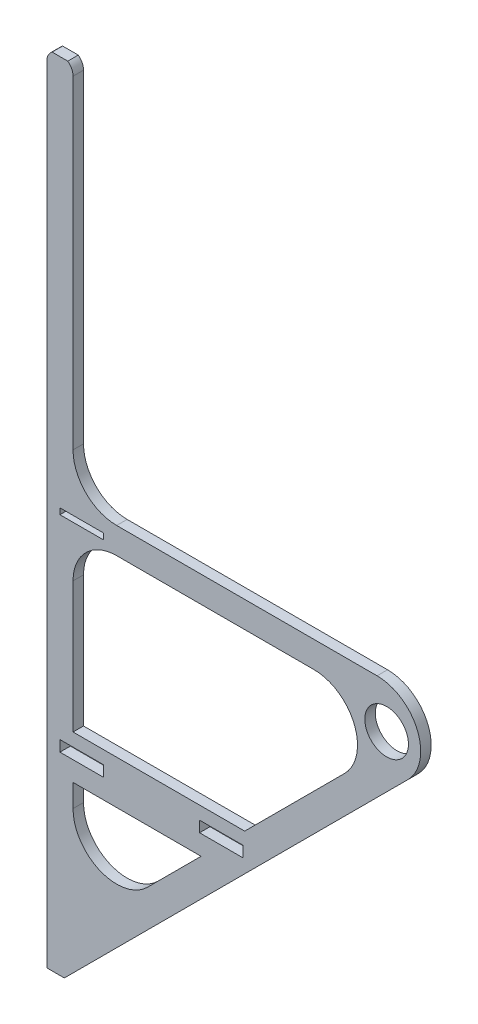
ISO-10303-21;
HEADER;
FILE_DESCRIPTION(('STEP AP214'),'2;1');
FILE_NAME('part.step','',(''),(''),'','','');
FILE_SCHEMA(('AUTOMOTIVE_DESIGN { 1 0 10303 214 1 1 1 1 }'));
ENDSEC;
DATA;
#1=APPLICATION_CONTEXT('core data for automotive mechanical design processes');
#2=APPLICATION_PROTOCOL_DEFINITION('international standard','automotive_design',2000,#1);
#3=PRODUCT_CONTEXT('',#1,'mechanical');
#4=PRODUCT('Part','Part','',(#3));
#5=PRODUCT_RELATED_PRODUCT_CATEGORY('part','',(#4));
#6=PRODUCT_DEFINITION_FORMATION('','',#4);
#7=PRODUCT_DEFINITION_CONTEXT('part definition',#1,'design');
#8=PRODUCT_DEFINITION('design','',#6,#7);
#9=PRODUCT_DEFINITION_SHAPE('','',#8);
#10=(LENGTH_UNIT() NAMED_UNIT(*) SI_UNIT(.MILLI.,.METRE.));
#11=(NAMED_UNIT(*) PLANE_ANGLE_UNIT() SI_UNIT($,.RADIAN.));
#12=(NAMED_UNIT(*) SI_UNIT($,.STERADIAN.) SOLID_ANGLE_UNIT());
#13=UNCERTAINTY_MEASURE_WITH_UNIT(LENGTH_MEASURE(1.E-05),#10,'distance_accuracy_value','');
#14=(GEOMETRIC_REPRESENTATION_CONTEXT(3) GLOBAL_UNCERTAINTY_ASSIGNED_CONTEXT((#13)) GLOBAL_UNIT_ASSIGNED_CONTEXT((#10,
#11,#12)) REPRESENTATION_CONTEXT('',''));
#15=CARTESIAN_POINT('',(0.,0.,0.));
#16=DIRECTION('',(0.,0.,1.));
#17=DIRECTION('',(1.,0.,0.));
#18=AXIS2_PLACEMENT_3D('',#15,#16,#17);
#19=CARTESIAN_POINT('',(378.43890071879,429.149578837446,12.));
#20=DIRECTION('',(0.,0.,1.));
#21=DIRECTION('',(1.,0.,0.));
#22=AXIS2_PLACEMENT_3D('',#19,#20,#21);
#23=PLANE('',#22);
#24=DIRECTION('',(0.,-1.,0.));
#25=VECTOR('',#24,1.);
#26=CARTESIAN_POINT('',(175.,234.149578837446,12.));
#27=LINE('',#26,#25);
#28=CARTESIAN_POINT('',(175.,234.149578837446,12.));
#29=VERTEX_POINT('',#28);
#30=CARTESIAN_POINT('',(175.,221.649578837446,12.));
#31=VERTEX_POINT('',#30);
#32=EDGE_CURVE('E48',#29,#31,#27,.T.);
#33=ORIENTED_EDGE('',*,*,#32,.F.);
#34=DIRECTION('',(-1.,0.,0.));
#35=VECTOR('',#34,1.);
#36=CARTESIAN_POINT('',(175.,234.149578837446,12.));
#37=LINE('',#36,#35);
#38=CARTESIAN_POINT('',(225.,234.149578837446,12.));
#39=VERTEX_POINT('',#38);
#40=EDGE_CURVE('E260',#39,#29,#37,.T.);
#41=ORIENTED_EDGE('',*,*,#40,.F.);
#42=DIRECTION('',(0.,1.,0.));
#43=VECTOR('',#42,1.);
#44=CARTESIAN_POINT('',(225.,234.149578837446,12.));
#45=LINE('',#44,#43);
#46=CARTESIAN_POINT('',(225.,221.649578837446,12.));
#47=VERTEX_POINT('',#46);
#48=EDGE_CURVE('E263',#47,#39,#45,.T.);
#49=ORIENTED_EDGE('',*,*,#48,.F.);
#50=DIRECTION('',(1.,0.,0.));
#51=VECTOR('',#50,1.);
#52=CARTESIAN_POINT('',(175.,221.649578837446,12.));
#53=LINE('',#52,#51);
#54=EDGE_CURVE('E269',#31,#47,#53,.T.);
#55=ORIENTED_EDGE('',*,*,#54,.F.);
#56=EDGE_LOOP('',(#33,#41,#49,#55));
#57=FACE_BOUND('',#56,.T.);
#58=DIRECTION('',(0.,-1.,0.));
#59=VECTOR('',#58,1.);
#60=CARTESIAN_POINT('',(14.9999999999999,234.149578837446,12.));
#61=LINE('',#60,#59);
#62=CARTESIAN_POINT('',(14.9999999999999,234.149578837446,12.));
#63=VERTEX_POINT('',#62);
#64=CARTESIAN_POINT('',(14.9999999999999,221.649578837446,12.));
#65=VERTEX_POINT('',#64);
#66=EDGE_CURVE('E275',#63,#65,#61,.T.);
#67=ORIENTED_EDGE('',*,*,#66,.F.);
#68=DIRECTION('',(-1.,0.,0.));
#69=VECTOR('',#68,1.);
#70=CARTESIAN_POINT('',(14.9999999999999,234.149578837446,12.));
#71=LINE('',#70,#69);
#72=CARTESIAN_POINT('',(64.9999999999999,234.149578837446,12.));
#73=VERTEX_POINT('',#72);
#74=EDGE_CURVE('E283',#73,#63,#71,.T.);
#75=ORIENTED_EDGE('',*,*,#74,.F.);
#76=DIRECTION('',(0.,1.,0.));
#77=VECTOR('',#76,1.);
#78=CARTESIAN_POINT('',(64.9999999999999,234.149578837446,12.));
#79=LINE('',#78,#77);
#80=CARTESIAN_POINT('',(64.9999999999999,221.649578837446,12.));
#81=VERTEX_POINT('',#80);
#82=EDGE_CURVE('E297',#81,#73,#79,.T.);
#83=ORIENTED_EDGE('',*,*,#82,.F.);
#84=DIRECTION('',(1.,0.,0.));
#85=VECTOR('',#84,1.);
#86=CARTESIAN_POINT('',(14.9999999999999,221.649578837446,12.));
#87=LINE('',#86,#85);
#88=EDGE_CURVE('E294',#65,#81,#87,.T.);
#89=ORIENTED_EDGE('',*,*,#88,.F.);
#90=EDGE_LOOP('',(#67,#75,#83,#89));
#91=FACE_BOUND('',#90,.T.);
#92=DIRECTION('',(0.707106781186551,0.707106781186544,0.));
#93=VECTOR('',#92,1.);
#94=CARTESIAN_POINT('',(176.72317196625,199.149578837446,12.));
#95=LINE('',#94,#93);
#96=CARTESIAN_POINT('',(115.355339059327,137.781745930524,12.));
#97=VERTEX_POINT('',#96);
#98=CARTESIAN_POINT('',(176.72317196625,199.149578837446,12.));
#99=VERTEX_POINT('',#98);
#100=EDGE_CURVE('E350',#97,#99,#95,.T.);
#101=ORIENTED_EDGE('',*,*,#100,.F.);
#102=CARTESIAN_POINT('',(80.,173.137084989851,12.));
#103=DIRECTION('',(0.,0.,1.));
#104=DIRECTION('',(1.,0.,0.));
#105=AXIS2_PLACEMENT_3D('',#102,#103,#104);
#106=CIRCLE('',#105,50.);
#107=CARTESIAN_POINT('',(30.,173.137084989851,12.));
#108=VERTEX_POINT('',#107);
#109=EDGE_CURVE('E348',#108,#97,#106,.T.);
#110=ORIENTED_EDGE('',*,*,#109,.F.);
#111=DIRECTION('',(0.,-1.,0.));
#112=VECTOR('',#111,1.);
#113=CARTESIAN_POINT('',(30.,173.137084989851,12.));
#114=LINE('',#113,#112);
#115=CARTESIAN_POINT('',(30.,199.149578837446,12.));
#116=VERTEX_POINT('',#115);
#117=EDGE_CURVE('E356',#116,#108,#114,.T.);
#118=ORIENTED_EDGE('',*,*,#117,.F.);
#119=DIRECTION('',(-1.,0.,0.));
#120=VECTOR('',#119,1.);
#121=CARTESIAN_POINT('',(30.,199.149578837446,12.));
#122=LINE('',#121,#120);
#123=EDGE_CURVE('E353',#99,#116,#122,.T.);
#124=ORIENTED_EDGE('',*,*,#123,.F.);
#125=EDGE_LOOP('',(#101,#110,#118,#124));
#126=FACE_BOUND('',#125,.T.);
#127=DIRECTION('',(0.,-1.,0.));
#128=VECTOR('',#127,1.);
#129=CARTESIAN_POINT('',(30.,249.149578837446,12.));
#130=LINE('',#129,#128);
#131=CARTESIAN_POINT('',(30.,399.149578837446,12.));
#132=VERTEX_POINT('',#131);
#133=CARTESIAN_POINT('',(30.,249.149578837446,12.));
#134=VERTEX_POINT('',#133);
#135=EDGE_CURVE('E381',#132,#134,#130,.T.);
#136=ORIENTED_EDGE('',*,*,#135,.F.);
#137=CARTESIAN_POINT('',(80.,399.149578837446,12.));
#138=DIRECTION('',(0.,0.,1.));
#139=DIRECTION('',(1.,0.,0.));
#140=AXIS2_PLACEMENT_3D('',#137,#138,#139);
#141=CIRCLE('',#140,50.);
#142=CARTESIAN_POINT('',(80.,449.149578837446,12.));
#143=VERTEX_POINT('',#142);
#144=EDGE_CURVE('E379',#143,#132,#141,.T.);
#145=ORIENTED_EDGE('',*,*,#144,.F.);
#146=DIRECTION('',(-1.,0.,0.));
#147=VECTOR('',#146,1.);
#148=CARTESIAN_POINT('',(80.,449.149578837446,12.));
#149=LINE('',#148,#147);
#150=CARTESIAN_POINT('',(306.012493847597,449.149578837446,12.));
#151=VERTEX_POINT('',#150);
#152=EDGE_CURVE('E391',#151,#143,#149,.T.);
#153=ORIENTED_EDGE('',*,*,#152,.F.);
#154=CARTESIAN_POINT('',(306.012493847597,399.149578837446,12.));
#155=DIRECTION('',(0.,0.,1.));
#156=DIRECTION('',(1.,0.,0.));
#157=AXIS2_PLACEMENT_3D('',#154,#155,#156);
#158=CIRCLE('',#157,50.);
#159=CARTESIAN_POINT('',(341.367832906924,363.794239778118,12.));
#160=VERTEX_POINT('',#159);
#161=EDGE_CURVE('E388',#160,#151,#158,.T.);
#162=ORIENTED_EDGE('',*,*,#161,.F.);
#163=DIRECTION('',(0.707106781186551,0.707106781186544,0.));
#164=VECTOR('',#163,1.);
#165=CARTESIAN_POINT('',(341.367832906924,363.794239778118,12.));
#166=LINE('',#165,#164);
#167=CARTESIAN_POINT('',(226.72317196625,249.149578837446,12.));
#168=VERTEX_POINT('',#167);
#169=EDGE_CURVE('E386',#168,#160,#166,.T.);
#170=ORIENTED_EDGE('',*,*,#169,.F.);
#171=DIRECTION('',(1.,0.,0.));
#172=VECTOR('',#171,1.);
#173=CARTESIAN_POINT('',(30.,249.149578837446,12.));
#174=LINE('',#173,#172);
#175=EDGE_CURVE('E384',#134,#168,#174,.T.);
#176=ORIENTED_EDGE('',*,*,#175,.F.);
#177=EDGE_LOOP('',(#136,#145,#153,#162,#170,#176));
#178=FACE_BOUND('',#177,.T.);
#179=DIRECTION('',(0.,-1.,0.));
#180=VECTOR('',#179,1.);
#181=CARTESIAN_POINT('',(0.,900.,12.));
#182=LINE('',#181,#180);
#183=CARTESIAN_POINT('',(0.,900.,12.));
#184=VERTEX_POINT('',#183);
#185=CARTESIAN_POINT('',(0.,0.,12.));
#186=VERTEX_POINT('',#185);
#187=EDGE_CURVE('E424',#184,#186,#182,.T.);
#188=ORIENTED_EDGE('',*,*,#187,.T.);
#189=DIRECTION('',(1.,0.,0.));
#190=VECTOR('',#189,1.);
#191=CARTESIAN_POINT('',(0.,0.,12.));
#192=LINE('',#191,#190);
#193=CARTESIAN_POINT('',(19.9999999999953,0.,12.));
#194=VERTEX_POINT('',#193);
#195=EDGE_CURVE('E426',#186,#194,#192,.T.);
#196=ORIENTED_EDGE('',*,*,#195,.T.);
#197=DIRECTION('',(0.707106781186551,0.707106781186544,0.));
#198=VECTOR('',#197,1.);
#199=CARTESIAN_POINT('',(19.9999999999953,0.,12.));
#200=LINE('',#199,#198);
#201=CARTESIAN_POINT('',(413.794239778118,393.794239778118,12.));
#202=VERTEX_POINT('',#201);
#203=EDGE_CURVE('E429',#194,#202,#200,.T.);
#204=ORIENTED_EDGE('',*,*,#203,.T.);
#205=CARTESIAN_POINT('',(378.43890071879,429.149578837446,12.));
#206=DIRECTION('',(0.,0.,1.));
#207=DIRECTION('',(1.,0.,0.));
#208=AXIS2_PLACEMENT_3D('',#205,#206,#207);
#209=CIRCLE('',#208,50.);
#210=CARTESIAN_POINT('',(378.43890071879,479.149578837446,12.));
#211=VERTEX_POINT('',#210);
#212=EDGE_CURVE('E431',#202,#211,#209,.T.);
#213=ORIENTED_EDGE('',*,*,#212,.T.);
#214=DIRECTION('',(-1.,0.,0.));
#215=VECTOR('',#214,1.);
#216=CARTESIAN_POINT('',(378.43890071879,479.149578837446,12.));
#217=LINE('',#216,#215);
#218=CARTESIAN_POINT('',(80.0000000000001,479.149578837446,12.));
#219=VERTEX_POINT('',#218);
#220=EDGE_CURVE('E433',#211,#219,#217,.T.);
#221=ORIENTED_EDGE('',*,*,#220,.T.);
#222=CARTESIAN_POINT('',(80.0000000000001,529.149578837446,12.));
#223=DIRECTION('',(0.,0.,-1.));
#224=DIRECTION('',(-1.,0.,0.));
#225=AXIS2_PLACEMENT_3D('',#222,#223,#224);
#226=CIRCLE('',#225,50.);
#227=CARTESIAN_POINT('',(30.0000000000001,529.149578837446,12.));
#228=VERTEX_POINT('',#227);
#229=EDGE_CURVE('E435',#219,#228,#226,.T.);
#230=ORIENTED_EDGE('',*,*,#229,.T.);
#231=DIRECTION('',(0.,1.,0.));
#232=VECTOR('',#231,1.);
#233=CARTESIAN_POINT('',(29.9999999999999,900.,12.));
#234=LINE('',#233,#232);
#235=CARTESIAN_POINT('',(29.9999999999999,900.,12.));
#236=VERTEX_POINT('',#235);
#237=EDGE_CURVE('E437',#228,#236,#234,.T.);
#238=ORIENTED_EDGE('',*,*,#237,.T.);
#239=CARTESIAN_POINT('',(14.9999999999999,900.,12.));
#240=DIRECTION('',(0.,0.,1.));
#241=DIRECTION('',(-1.,0.,0.));
#242=AXIS2_PLACEMENT_3D('',#239,#240,#241);
#243=CIRCLE('',#242,15.);
#244=CARTESIAN_POINT('',(23.9999999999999,912.,12.));
#245=VERTEX_POINT('',#244);
#246=EDGE_CURVE('E439',#236,#245,#243,.T.);
#247=ORIENTED_EDGE('',*,*,#246,.T.);
#248=DIRECTION('',(-1.,0.,0.));
#249=VECTOR('',#248,1.);
#250=CARTESIAN_POINT('',(5.99999999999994,912.,12.));
#251=LINE('',#250,#249);
#252=CARTESIAN_POINT('',(5.99999999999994,912.,12.));
#253=VERTEX_POINT('',#252);
#254=EDGE_CURVE('E441',#245,#253,#251,.T.);
#255=ORIENTED_EDGE('',*,*,#254,.T.);
#256=CARTESIAN_POINT('',(14.9999999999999,900.,12.));
#257=DIRECTION('',(0.,0.,1.));
#258=DIRECTION('',(-1.,0.,0.));
#259=AXIS2_PLACEMENT_3D('',#256,#257,#258);
#260=CIRCLE('',#259,15.);
#261=EDGE_CURVE('E443',#253,#184,#260,.T.);
#262=ORIENTED_EDGE('',*,*,#261,.T.);
#263=EDGE_LOOP('',(#188,#196,#204,#213,#221,#230,#238,#247,#255,#262));
#264=FACE_BOUND('',#263,.T.);
#265=CARTESIAN_POINT('',(389.394289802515,429.149578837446,12.));
#266=DIRECTION('',(0.,0.,1.));
#267=DIRECTION('',(1.,0.,0.));
#268=AXIS2_PLACEMENT_3D('',#265,#266,#267);
#269=CIRCLE('',#268,25.);
#270=CARTESIAN_POINT('',(414.394289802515,429.149578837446,12.));
#271=VERTEX_POINT('',#270);
#272=EDGE_CURVE('E342',#271,#271,#269,.T.);
#273=ORIENTED_EDGE('',*,*,#272,.F.);
#274=EDGE_LOOP('',(#273));
#275=FACE_BOUND('',#274,.T.);
#276=DIRECTION('',(1.,0.,0.));
#277=VECTOR('',#276,1.);
#278=CARTESIAN_POINT('',(15.,457.294722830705,12.));
#279=LINE('',#278,#277);
#280=CARTESIAN_POINT('',(15.,457.294722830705,12.));
#281=VERTEX_POINT('',#280);
#282=CARTESIAN_POINT('',(65.,457.294722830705,12.));
#283=VERTEX_POINT('',#282);
#284=EDGE_CURVE('E313',#281,#283,#279,.T.);
#285=ORIENTED_EDGE('',*,*,#284,.F.);
#286=DIRECTION('',(0.,-1.,0.));
#287=VECTOR('',#286,1.);
#288=CARTESIAN_POINT('',(15.,457.294722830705,12.));
#289=LINE('',#288,#287);
#290=CARTESIAN_POINT('',(15.,464.149578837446,12.));
#291=VERTEX_POINT('',#290);
#292=EDGE_CURVE('E311',#291,#281,#289,.T.);
#293=ORIENTED_EDGE('',*,*,#292,.F.);
#294=DIRECTION('',(-1.,0.,0.));
#295=VECTOR('',#294,1.);
#296=CARTESIAN_POINT('',(15.,464.149578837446,12.));
#297=LINE('',#296,#295);
#298=CARTESIAN_POINT('',(65.,464.149578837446,12.));
#299=VERTEX_POINT('',#298);
#300=EDGE_CURVE('E319',#299,#291,#297,.T.);
#301=ORIENTED_EDGE('',*,*,#300,.F.);
#302=DIRECTION('',(0.,1.,0.));
#303=VECTOR('',#302,1.);
#304=CARTESIAN_POINT('',(65.,457.294722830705,12.));
#305=LINE('',#304,#303);
#306=EDGE_CURVE('E316',#283,#299,#305,.T.);
#307=ORIENTED_EDGE('',*,*,#306,.F.);
#308=EDGE_LOOP('',(#285,#293,#301,#307));
#309=FACE_BOUND('',#308,.T.);
#310=ADVANCED_FACE('F33',(#57,#91,#126,#178,#264,#275,#309),#23,.T.);
#311=CARTESIAN_POINT('',(378.43890071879,429.149578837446,0.));
#312=DIRECTION('',(0.,0.,1.));
#313=DIRECTION('',(1.,0.,0.));
#314=AXIS2_PLACEMENT_3D('',#311,#312,#313);
#315=PLANE('',#314);
#316=DIRECTION('',(-1.,0.,0.));
#317=VECTOR('',#316,1.);
#318=CARTESIAN_POINT('',(175.,234.149578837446,0.));
#319=LINE('',#318,#317);
#320=CARTESIAN_POINT('',(225.,234.149578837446,0.));
#321=VERTEX_POINT('',#320);
#322=CARTESIAN_POINT('',(175.,234.149578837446,0.));
#323=VERTEX_POINT('',#322);
#324=EDGE_CURVE('E250',#321,#323,#319,.T.);
#325=ORIENTED_EDGE('',*,*,#324,.T.);
#326=DIRECTION('',(0.,-1.,0.));
#327=VECTOR('',#326,1.);
#328=CARTESIAN_POINT('',(175.,234.149578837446,0.));
#329=LINE('',#328,#327);
#330=CARTESIAN_POINT('',(175.,221.649578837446,0.));
#331=VERTEX_POINT('',#330);
#332=EDGE_CURVE('E244',#323,#331,#329,.T.);
#333=ORIENTED_EDGE('',*,*,#332,.T.);
#334=DIRECTION('',(1.,0.,0.));
#335=VECTOR('',#334,1.);
#336=CARTESIAN_POINT('',(175.,221.649578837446,0.));
#337=LINE('',#336,#335);
#338=CARTESIAN_POINT('',(225.,221.649578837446,0.));
#339=VERTEX_POINT('',#338);
#340=EDGE_CURVE('E253',#331,#339,#337,.T.);
#341=ORIENTED_EDGE('',*,*,#340,.T.);
#342=DIRECTION('',(0.,1.,0.));
#343=VECTOR('',#342,1.);
#344=CARTESIAN_POINT('',(225.,234.149578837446,0.));
#345=LINE('',#344,#343);
#346=EDGE_CURVE('E56',#339,#321,#345,.T.);
#347=ORIENTED_EDGE('',*,*,#346,.T.);
#348=EDGE_LOOP('',(#325,#333,#341,#347));
#349=FACE_BOUND('',#348,.T.);
#350=DIRECTION('',(-1.,0.,0.));
#351=VECTOR('',#350,1.);
#352=CARTESIAN_POINT('',(14.9999999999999,234.149578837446,0.));
#353=LINE('',#352,#351);
#354=CARTESIAN_POINT('',(64.9999999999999,234.149578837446,0.));
#355=VERTEX_POINT('',#354);
#356=CARTESIAN_POINT('',(14.9999999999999,234.149578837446,0.));
#357=VERTEX_POINT('',#356);
#358=EDGE_CURVE('E289',#355,#357,#353,.T.);
#359=ORIENTED_EDGE('',*,*,#358,.T.);
#360=DIRECTION('',(0.,-1.,0.));
#361=VECTOR('',#360,1.);
#362=CARTESIAN_POINT('',(14.9999999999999,234.149578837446,0.));
#363=LINE('',#362,#361);
#364=CARTESIAN_POINT('',(14.9999999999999,221.649578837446,0.));
#365=VERTEX_POINT('',#364);
#366=EDGE_CURVE('E279',#357,#365,#363,.T.);
#367=ORIENTED_EDGE('',*,*,#366,.T.);
#368=DIRECTION('',(1.,0.,0.));
#369=VECTOR('',#368,1.);
#370=CARTESIAN_POINT('',(14.9999999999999,221.649578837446,0.));
#371=LINE('',#370,#369);
#372=CARTESIAN_POINT('',(65.,221.649578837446,0.));
#373=VERTEX_POINT('',#372);
#374=EDGE_CURVE('E282',#365,#373,#371,.T.);
#375=ORIENTED_EDGE('',*,*,#374,.T.);
#376=DIRECTION('',(0.,1.,0.));
#377=VECTOR('',#376,1.);
#378=CARTESIAN_POINT('',(64.9999999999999,234.149578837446,0.));
#379=LINE('',#378,#377);
#380=EDGE_CURVE('E286',#373,#355,#379,.T.);
#381=ORIENTED_EDGE('',*,*,#380,.T.);
#382=EDGE_LOOP('',(#359,#367,#375,#381));
#383=FACE_BOUND('',#382,.T.);
#384=CARTESIAN_POINT('',(389.394289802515,429.149578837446,0.));
#385=DIRECTION('',(0.,0.,1.));
#386=DIRECTION('',(1.,0.,0.));
#387=AXIS2_PLACEMENT_3D('',#384,#385,#386);
#388=CIRCLE('',#387,25.);
#389=CARTESIAN_POINT('',(414.394289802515,429.149578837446,0.));
#390=VERTEX_POINT('',#389);
#391=EDGE_CURVE('E341',#390,#390,#388,.T.);
#392=ORIENTED_EDGE('',*,*,#391,.T.);
#393=EDGE_LOOP('',(#392));
#394=FACE_BOUND('',#393,.T.);
#395=CARTESIAN_POINT('',(80.,173.137084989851,0.));
#396=DIRECTION('',(0.,0.,1.));
#397=DIRECTION('',(1.,0.,0.));
#398=AXIS2_PLACEMENT_3D('',#395,#396,#397);
#399=CIRCLE('',#398,50.);
#400=CARTESIAN_POINT('',(30.,173.137084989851,0.));
#401=VERTEX_POINT('',#400);
#402=CARTESIAN_POINT('',(115.355339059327,137.781745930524,0.));
#403=VERTEX_POINT('',#402);
#404=EDGE_CURVE('E345',#401,#403,#399,.T.);
#405=ORIENTED_EDGE('',*,*,#404,.T.);
#406=DIRECTION('',(0.707106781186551,0.707106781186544,0.));
#407=VECTOR('',#406,1.);
#408=CARTESIAN_POINT('',(176.72317196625,199.149578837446,0.));
#409=LINE('',#408,#407);
#410=CARTESIAN_POINT('',(176.72317196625,199.149578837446,0.));
#411=VERTEX_POINT('',#410);
#412=EDGE_CURVE('E361',#403,#411,#409,.T.);
#413=ORIENTED_EDGE('',*,*,#412,.T.);
#414=DIRECTION('',(-1.,0.,0.));
#415=VECTOR('',#414,1.);
#416=CARTESIAN_POINT('',(30.,199.149578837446,0.));
#417=LINE('',#416,#415);
#418=CARTESIAN_POINT('',(30.,199.149578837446,0.));
#419=VERTEX_POINT('',#418);
#420=EDGE_CURVE('E364',#411,#419,#417,.T.);
#421=ORIENTED_EDGE('',*,*,#420,.T.);
#422=DIRECTION('',(0.,-1.,0.));
#423=VECTOR('',#422,1.);
#424=CARTESIAN_POINT('',(30.,173.137084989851,0.));
#425=LINE('',#424,#423);
#426=EDGE_CURVE('E351',#419,#401,#425,.T.);
#427=ORIENTED_EDGE('',*,*,#426,.T.);
#428=EDGE_LOOP('',(#405,#413,#421,#427));
#429=FACE_BOUND('',#428,.T.);
#430=DIRECTION('',(0.,-1.,0.));
#431=VECTOR('',#430,1.);
#432=CARTESIAN_POINT('',(0.,450.,0.));
#433=LINE('',#432,#431);
#434=CARTESIAN_POINT('',(0.,900.,0.));
#435=VERTEX_POINT('',#434);
#436=CARTESIAN_POINT('',(0.,0.,0.));
#437=VERTEX_POINT('',#436);
#438=EDGE_CURVE('E423',#435,#437,#433,.T.);
#439=ORIENTED_EDGE('',*,*,#438,.F.);
#440=CARTESIAN_POINT('',(14.9999999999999,900.,0.));
#441=DIRECTION('',(0.,0.,1.));
#442=DIRECTION('',(-1.,0.,0.));
#443=AXIS2_PLACEMENT_3D('',#440,#441,#442);
#444=CIRCLE('',#443,15.);
#445=CARTESIAN_POINT('',(5.99999999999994,912.,0.));
#446=VERTEX_POINT('',#445);
#447=EDGE_CURVE('E427',#446,#435,#444,.T.);
#448=ORIENTED_EDGE('',*,*,#447,.F.);
#449=DIRECTION('',(-1.,0.,0.));
#450=VECTOR('',#449,1.);
#451=CARTESIAN_POINT('',(5.99999999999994,912.,0.));
#452=LINE('',#451,#450);
#453=CARTESIAN_POINT('',(23.9999999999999,912.,0.));
#454=VERTEX_POINT('',#453);
#455=EDGE_CURVE('E461',#454,#446,#452,.T.);
#456=ORIENTED_EDGE('',*,*,#455,.F.);
#457=CARTESIAN_POINT('',(14.9999999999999,900.,0.));
#458=DIRECTION('',(0.,0.,1.));
#459=DIRECTION('',(-1.,0.,0.));
#460=AXIS2_PLACEMENT_3D('',#457,#458,#459);
#461=CIRCLE('',#460,15.);
#462=CARTESIAN_POINT('',(29.9999999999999,900.,0.));
#463=VERTEX_POINT('',#462);
#464=EDGE_CURVE('E459',#463,#454,#461,.T.);
#465=ORIENTED_EDGE('',*,*,#464,.F.);
#466=DIRECTION('',(0.,1.,0.));
#467=VECTOR('',#466,1.);
#468=CARTESIAN_POINT('',(29.9999999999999,900.,0.));
#469=LINE('',#468,#467);
#470=CARTESIAN_POINT('',(30.0000000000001,529.149578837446,0.));
#471=VERTEX_POINT('',#470);
#472=EDGE_CURVE('E457',#471,#463,#469,.T.);
#473=ORIENTED_EDGE('',*,*,#472,.F.);
#474=CARTESIAN_POINT('',(80.0000000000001,529.149578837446,0.));
#475=DIRECTION('',(0.,0.,-1.));
#476=DIRECTION('',(-1.,0.,0.));
#477=AXIS2_PLACEMENT_3D('',#474,#475,#476);
#478=CIRCLE('',#477,50.);
#479=CARTESIAN_POINT('',(80.0000000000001,479.149578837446,0.));
#480=VERTEX_POINT('',#479);
#481=EDGE_CURVE('E455',#480,#471,#478,.T.);
#482=ORIENTED_EDGE('',*,*,#481,.F.);
#483=DIRECTION('',(-1.,0.,0.));
#484=VECTOR('',#483,1.);
#485=CARTESIAN_POINT('',(378.43890071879,479.149578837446,0.));
#486=LINE('',#485,#484);
#487=CARTESIAN_POINT('',(378.43890071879,479.149578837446,0.));
#488=VERTEX_POINT('',#487);
#489=EDGE_CURVE('E453',#488,#480,#486,.T.);
#490=ORIENTED_EDGE('',*,*,#489,.F.);
#491=CARTESIAN_POINT('',(378.43890071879,429.149578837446,0.));
#492=DIRECTION('',(0.,0.,1.));
#493=DIRECTION('',(1.,0.,0.));
#494=AXIS2_PLACEMENT_3D('',#491,#492,#493);
#495=CIRCLE('',#494,50.);
#496=CARTESIAN_POINT('',(413.794239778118,393.794239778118,0.));
#497=VERTEX_POINT('',#496);
#498=EDGE_CURVE('E451',#497,#488,#495,.T.);
#499=ORIENTED_EDGE('',*,*,#498,.F.);
#500=DIRECTION('',(0.707106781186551,0.707106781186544,0.));
#501=VECTOR('',#500,1.);
#502=CARTESIAN_POINT('',(19.9999999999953,0.,0.));
#503=LINE('',#502,#501);
#504=CARTESIAN_POINT('',(19.9999999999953,0.,0.));
#505=VERTEX_POINT('',#504);
#506=EDGE_CURVE('E449',#505,#497,#503,.T.);
#507=ORIENTED_EDGE('',*,*,#506,.F.);
#508=DIRECTION('',(1.,0.,0.));
#509=VECTOR('',#508,1.);
#510=CARTESIAN_POINT('',(0.,0.,0.));
#511=LINE('',#510,#509);
#512=EDGE_CURVE('E447',#437,#505,#511,.T.);
#513=ORIENTED_EDGE('',*,*,#512,.F.);
#514=EDGE_LOOP('',(#439,#448,#456,#465,#473,#482,#490,#499,#507,#513));
#515=FACE_BOUND('',#514,.T.);
#516=CARTESIAN_POINT('',(80.,399.149578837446,0.));
#517=DIRECTION('',(0.,0.,1.));
#518=DIRECTION('',(1.,0.,0.));
#519=AXIS2_PLACEMENT_3D('',#516,#517,#518);
#520=CIRCLE('',#519,50.);
#521=CARTESIAN_POINT('',(80.,449.149578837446,0.));
#522=VERTEX_POINT('',#521);
#523=CARTESIAN_POINT('',(30.,399.149578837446,0.));
#524=VERTEX_POINT('',#523);
#525=EDGE_CURVE('E378',#522,#524,#520,.T.);
#526=ORIENTED_EDGE('',*,*,#525,.T.);
#527=DIRECTION('',(0.,-1.,0.));
#528=VECTOR('',#527,1.);
#529=CARTESIAN_POINT('',(30.,249.149578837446,0.));
#530=LINE('',#529,#528);
#531=CARTESIAN_POINT('',(30.,249.149578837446,0.));
#532=VERTEX_POINT('',#531);
#533=EDGE_CURVE('E396',#524,#532,#530,.T.);
#534=ORIENTED_EDGE('',*,*,#533,.T.);
#535=DIRECTION('',(1.,0.,0.));
#536=VECTOR('',#535,1.);
#537=CARTESIAN_POINT('',(30.,249.149578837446,0.));
#538=LINE('',#537,#536);
#539=CARTESIAN_POINT('',(226.72317196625,249.149578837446,0.));
#540=VERTEX_POINT('',#539);
#541=EDGE_CURVE('E399',#532,#540,#538,.T.);
#542=ORIENTED_EDGE('',*,*,#541,.T.);
#543=DIRECTION('',(0.707106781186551,0.707106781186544,0.));
#544=VECTOR('',#543,1.);
#545=CARTESIAN_POINT('',(341.367832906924,363.794239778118,0.));
#546=LINE('',#545,#544);
#547=CARTESIAN_POINT('',(341.367832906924,363.794239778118,0.));
#548=VERTEX_POINT('',#547);
#549=EDGE_CURVE('E402',#540,#548,#546,.T.);
#550=ORIENTED_EDGE('',*,*,#549,.T.);
#551=CARTESIAN_POINT('',(306.012493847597,399.149578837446,0.));
#552=DIRECTION('',(0.,0.,1.));
#553=DIRECTION('',(1.,0.,0.));
#554=AXIS2_PLACEMENT_3D('',#551,#552,#553);
#555=CIRCLE('',#554,50.);
#556=CARTESIAN_POINT('',(306.012493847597,449.149578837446,0.));
#557=VERTEX_POINT('',#556);
#558=EDGE_CURVE('E405',#548,#557,#555,.T.);
#559=ORIENTED_EDGE('',*,*,#558,.T.);
#560=DIRECTION('',(-1.,0.,0.));
#561=VECTOR('',#560,1.);
#562=CARTESIAN_POINT('',(80.,449.149578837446,0.));
#563=LINE('',#562,#561);
#564=EDGE_CURVE('E382',#557,#522,#563,.T.);
#565=ORIENTED_EDGE('',*,*,#564,.T.);
#566=EDGE_LOOP('',(#526,#534,#542,#550,#559,#565));
#567=FACE_BOUND('',#566,.T.);
#568=DIRECTION('',(0.,-1.,0.));
#569=VECTOR('',#568,1.);
#570=CARTESIAN_POINT('',(15.,457.294722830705,0.));
#571=LINE('',#570,#569);
#572=CARTESIAN_POINT('',(15.,464.149578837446,0.));
#573=VERTEX_POINT('',#572);
#574=CARTESIAN_POINT('',(15.,457.294722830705,0.));
#575=VERTEX_POINT('',#574);
#576=EDGE_CURVE('E304',#573,#575,#571,.T.);
#577=ORIENTED_EDGE('',*,*,#576,.T.);
#578=DIRECTION('',(1.,0.,0.));
#579=VECTOR('',#578,1.);
#580=CARTESIAN_POINT('',(15.,457.294722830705,0.));
#581=LINE('',#580,#579);
#582=CARTESIAN_POINT('',(65.,457.294722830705,0.));
#583=VERTEX_POINT('',#582);
#584=EDGE_CURVE('E324',#575,#583,#581,.T.);
#585=ORIENTED_EDGE('',*,*,#584,.T.);
#586=DIRECTION('',(0.,1.,0.));
#587=VECTOR('',#586,1.);
#588=CARTESIAN_POINT('',(65.,457.294722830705,0.));
#589=LINE('',#588,#587);
#590=CARTESIAN_POINT('',(65.,464.149578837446,0.));
#591=VERTEX_POINT('',#590);
#592=EDGE_CURVE('E327',#583,#591,#589,.T.);
#593=ORIENTED_EDGE('',*,*,#592,.T.);
#594=DIRECTION('',(-1.,0.,0.));
#595=VECTOR('',#594,1.);
#596=CARTESIAN_POINT('',(15.,464.149578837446,0.));
#597=LINE('',#596,#595);
#598=EDGE_CURVE('E314',#591,#573,#597,.T.);
#599=ORIENTED_EDGE('',*,*,#598,.T.);
#600=EDGE_LOOP('',(#577,#585,#593,#599));
#601=FACE_BOUND('',#600,.T.);
#602=ADVANCED_FACE('F257',(#349,#383,#394,#429,#515,#567,#601),#315,.F.);
#603=CARTESIAN_POINT('',(0.,450.,12.));
#604=DIRECTION('',(1.,0.,0.));
#605=DIRECTION('',(0.,1.,0.));
#606=AXIS2_PLACEMENT_3D('',#603,#604,#605);
#607=PLANE('',#606);
#608=ORIENTED_EDGE('',*,*,#438,.T.);
#609=DIRECTION('',(0.,0.,-1.));
#610=VECTOR('',#609,1.);
#611=CARTESIAN_POINT('',(0.,0.,12.));
#612=LINE('',#611,#610);
#613=EDGE_CURVE('E11',#186,#437,#612,.T.);
#614=ORIENTED_EDGE('',*,*,#613,.F.);
#615=ORIENTED_EDGE('',*,*,#187,.F.);
#616=DIRECTION('',(0.,0.,-1.));
#617=VECTOR('',#616,1.);
#618=CARTESIAN_POINT('',(0.,900.,12.));
#619=LINE('',#618,#617);
#620=EDGE_CURVE('E445',#184,#435,#619,.T.);
#621=ORIENTED_EDGE('',*,*,#620,.T.);
#622=EDGE_LOOP('',(#608,#614,#615,#621));
#623=FACE_BOUND('',#622,.T.);
#624=ADVANCED_FACE('F35',(#623),#607,.F.);
#625=CARTESIAN_POINT('',(0.,0.,12.));
#626=DIRECTION('',(0.,1.,0.));
#627=DIRECTION('',(0.,0.,1.));
#628=AXIS2_PLACEMENT_3D('',#625,#626,#627);
#629=PLANE('',#628);
#630=ORIENTED_EDGE('',*,*,#512,.T.);
#631=DIRECTION('',(0.,0.,-1.));
#632=VECTOR('',#631,1.);
#633=CARTESIAN_POINT('',(19.9999999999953,0.,12.));
#634=LINE('',#633,#632);
#635=EDGE_CURVE('E41',#194,#505,#634,.T.);
#636=ORIENTED_EDGE('',*,*,#635,.F.);
#637=ORIENTED_EDGE('',*,*,#195,.F.);
#638=ORIENTED_EDGE('',*,*,#613,.T.);
#639=EDGE_LOOP('',(#630,#636,#637,#638));
#640=FACE_BOUND('',#639,.T.);
#641=ADVANCED_FACE('F516',(#640),#629,.F.);
#642=CARTESIAN_POINT('',(19.9999999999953,0.,12.));
#643=DIRECTION('',(-0.707106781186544,0.707106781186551,0.));
#644=DIRECTION('',(-0.707106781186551,-0.707106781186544,0.));
#645=AXIS2_PLACEMENT_3D('',#642,#643,#644);
#646=PLANE('',#645);
#647=ORIENTED_EDGE('',*,*,#506,.T.);
#648=DIRECTION('',(0.,0.,-1.));
#649=VECTOR('',#648,1.);
#650=CARTESIAN_POINT('',(413.794239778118,393.794239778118,12.));
#651=LINE('',#650,#649);
#652=EDGE_CURVE('E485',#202,#497,#651,.T.);
#653=ORIENTED_EDGE('',*,*,#652,.F.);
#654=ORIENTED_EDGE('',*,*,#203,.F.);
#655=ORIENTED_EDGE('',*,*,#635,.T.);
#656=EDGE_LOOP('',(#647,#653,#654,#655));
#657=FACE_BOUND('',#656,.T.);
#658=ADVANCED_FACE('F492',(#657),#646,.F.);
#659=CARTESIAN_POINT('',(378.43890071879,429.149578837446,12.));
#660=DIRECTION('',(0.,0.,-1.));
#661=DIRECTION('',(-1.,0.,0.));
#662=AXIS2_PLACEMENT_3D('',#659,#660,#661);
#663=CYLINDRICAL_SURFACE('',#662,50.);
#664=ORIENTED_EDGE('',*,*,#498,.T.);
#665=DIRECTION('',(0.,0.,-1.));
#666=VECTOR('',#665,1.);
#667=CARTESIAN_POINT('',(378.43890071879,479.149578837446,12.));
#668=LINE('',#667,#666);
#669=EDGE_CURVE('E482',#211,#488,#668,.T.);
#670=ORIENTED_EDGE('',*,*,#669,.F.);
#671=ORIENTED_EDGE('',*,*,#212,.F.);
#672=ORIENTED_EDGE('',*,*,#652,.T.);
#673=EDGE_LOOP('',(#664,#670,#671,#672));
#674=FACE_BOUND('',#673,.T.);
#675=ADVANCED_FACE('F504',(#674),#663,.T.);
#676=CARTESIAN_POINT('',(378.43890071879,479.149578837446,12.));
#677=DIRECTION('',(0.,-1.,0.));
#678=DIRECTION('',(0.,0.,-1.));
#679=AXIS2_PLACEMENT_3D('',#676,#677,#678);
#680=PLANE('',#679);
#681=ORIENTED_EDGE('',*,*,#489,.T.);
#682=DIRECTION('',(0.,0.,-1.));
#683=VECTOR('',#682,1.);
#684=CARTESIAN_POINT('',(80.0000000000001,479.149578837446,12.));
#685=LINE('',#684,#683);
#686=EDGE_CURVE('E479',#219,#480,#685,.T.);
#687=ORIENTED_EDGE('',*,*,#686,.F.);
#688=ORIENTED_EDGE('',*,*,#220,.F.);
#689=ORIENTED_EDGE('',*,*,#669,.T.);
#690=EDGE_LOOP('',(#681,#687,#688,#689));
#691=FACE_BOUND('',#690,.T.);
#692=ADVANCED_FACE('F508',(#691),#680,.F.);
#693=CARTESIAN_POINT('',(80.0000000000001,529.149578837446,12.));
#694=DIRECTION('',(0.,0.,-1.));
#695=DIRECTION('',(-1.,0.,0.));
#696=AXIS2_PLACEMENT_3D('',#693,#694,#695);
#697=CYLINDRICAL_SURFACE('',#696,50.);
#698=ORIENTED_EDGE('',*,*,#481,.T.);
#699=DIRECTION('',(0.,0.,-1.));
#700=VECTOR('',#699,1.);
#701=CARTESIAN_POINT('',(30.0000000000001,529.149578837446,12.));
#702=LINE('',#701,#700);
#703=EDGE_CURVE('E476',#228,#471,#702,.T.);
#704=ORIENTED_EDGE('',*,*,#703,.F.);
#705=ORIENTED_EDGE('',*,*,#229,.F.);
#706=ORIENTED_EDGE('',*,*,#686,.T.);
#707=EDGE_LOOP('',(#698,#704,#705,#706));
#708=FACE_BOUND('',#707,.T.);
#709=ADVANCED_FACE('F539',(#708),#697,.F.);
#710=CARTESIAN_POINT('',(29.9999999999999,900.,12.));
#711=DIRECTION('',(-1.,0.,0.));
#712=DIRECTION('',(0.,-1.,0.));
#713=AXIS2_PLACEMENT_3D('',#710,#711,#712);
#714=PLANE('',#713);
#715=ORIENTED_EDGE('',*,*,#472,.T.);
#716=DIRECTION('',(0.,0.,-1.));
#717=VECTOR('',#716,1.);
#718=CARTESIAN_POINT('',(29.9999999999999,900.,12.));
#719=LINE('',#718,#717);
#720=EDGE_CURVE('E473',#236,#463,#719,.T.);
#721=ORIENTED_EDGE('',*,*,#720,.F.);
#722=ORIENTED_EDGE('',*,*,#237,.F.);
#723=ORIENTED_EDGE('',*,*,#703,.T.);
#724=EDGE_LOOP('',(#715,#721,#722,#723));
#725=FACE_BOUND('',#724,.T.);
#726=ADVANCED_FACE('F537',(#725),#714,.F.);
#727=CARTESIAN_POINT('',(14.9999999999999,900.,12.));
#728=DIRECTION('',(0.,0.,-1.));
#729=DIRECTION('',(-1.,0.,0.));
#730=AXIS2_PLACEMENT_3D('',#727,#728,#729);
#731=CYLINDRICAL_SURFACE('',#730,15.);
#732=ORIENTED_EDGE('',*,*,#464,.T.);
#733=DIRECTION('',(0.,0.,-1.));
#734=VECTOR('',#733,1.);
#735=CARTESIAN_POINT('',(23.9999999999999,912.,12.));
#736=LINE('',#735,#734);
#737=EDGE_CURVE('E470',#245,#454,#736,.T.);
#738=ORIENTED_EDGE('',*,*,#737,.F.);
#739=ORIENTED_EDGE('',*,*,#246,.F.);
#740=ORIENTED_EDGE('',*,*,#720,.T.);
#741=EDGE_LOOP('',(#732,#738,#739,#740));
#742=FACE_BOUND('',#741,.T.);
#743=ADVANCED_FACE('F532',(#742),#731,.T.);
#744=CARTESIAN_POINT('',(5.99999999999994,912.,12.));
#745=DIRECTION('',(0.,-1.,0.));
#746=DIRECTION('',(0.,0.,-1.));
#747=AXIS2_PLACEMENT_3D('',#744,#745,#746);
#748=PLANE('',#747);
#749=ORIENTED_EDGE('',*,*,#455,.T.);
#750=DIRECTION('',(0.,0.,-1.));
#751=VECTOR('',#750,1.);
#752=CARTESIAN_POINT('',(5.99999999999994,912.,12.));
#753=LINE('',#752,#751);
#754=EDGE_CURVE('E467',#253,#446,#753,.T.);
#755=ORIENTED_EDGE('',*,*,#754,.F.);
#756=ORIENTED_EDGE('',*,*,#254,.F.);
#757=ORIENTED_EDGE('',*,*,#737,.T.);
#758=EDGE_LOOP('',(#749,#755,#756,#757));
#759=FACE_BOUND('',#758,.T.);
#760=ADVANCED_FACE('F527',(#759),#748,.F.);
#761=CARTESIAN_POINT('',(14.9999999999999,900.,12.));
#762=DIRECTION('',(0.,0.,-1.));
#763=DIRECTION('',(-1.,0.,0.));
#764=AXIS2_PLACEMENT_3D('',#761,#762,#763);
#765=CYLINDRICAL_SURFACE('',#764,15.);
#766=ORIENTED_EDGE('',*,*,#447,.T.);
#767=ORIENTED_EDGE('',*,*,#620,.F.);
#768=ORIENTED_EDGE('',*,*,#261,.F.);
#769=ORIENTED_EDGE('',*,*,#754,.T.);
#770=EDGE_LOOP('',(#766,#767,#768,#769));
#771=FACE_BOUND('',#770,.T.);
#772=ADVANCED_FACE('F522',(#771),#765,.T.);
#773=CARTESIAN_POINT('',(80.,399.149578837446,12.));
#774=DIRECTION('',(0.,0.,-1.));
#775=DIRECTION('',(-1.,0.,0.));
#776=AXIS2_PLACEMENT_3D('',#773,#774,#775);
#777=CYLINDRICAL_SURFACE('',#776,50.);
#778=ORIENTED_EDGE('',*,*,#525,.F.);
#779=DIRECTION('',(0.,0.,-1.));
#780=VECTOR('',#779,1.);
#781=CARTESIAN_POINT('',(80.,449.149578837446,12.));
#782=LINE('',#781,#780);
#783=EDGE_CURVE('E393',#143,#522,#782,.T.);
#784=ORIENTED_EDGE('',*,*,#783,.F.);
#785=ORIENTED_EDGE('',*,*,#144,.T.);
#786=DIRECTION('',(0.,0.,-1.));
#787=VECTOR('',#786,1.);
#788=CARTESIAN_POINT('',(30.,399.149578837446,12.));
#789=LINE('',#788,#787);
#790=EDGE_CURVE('E420',#132,#524,#789,.T.);
#791=ORIENTED_EDGE('',*,*,#790,.T.);
#792=EDGE_LOOP('',(#778,#784,#785,#791));
#793=FACE_BOUND('',#792,.T.);
#794=ADVANCED_FACE('F557',(#793),#777,.F.);
#795=CARTESIAN_POINT('',(30.,249.149578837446,12.));
#796=DIRECTION('',(1.,0.,0.));
#797=DIRECTION('',(0.,1.,0.));
#798=AXIS2_PLACEMENT_3D('',#795,#796,#797);
#799=PLANE('',#798);
#800=ORIENTED_EDGE('',*,*,#533,.F.);
#801=ORIENTED_EDGE('',*,*,#790,.F.);
#802=ORIENTED_EDGE('',*,*,#135,.T.);
#803=DIRECTION('',(0.,0.,-1.));
#804=VECTOR('',#803,1.);
#805=CARTESIAN_POINT('',(30.,249.149578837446,12.));
#806=LINE('',#805,#804);
#807=EDGE_CURVE('E418',#134,#532,#806,.T.);
#808=ORIENTED_EDGE('',*,*,#807,.T.);
#809=EDGE_LOOP('',(#800,#801,#802,#808));
#810=FACE_BOUND('',#809,.T.);
#811=ADVANCED_FACE('F583',(#810),#799,.T.);
#812=CARTESIAN_POINT('',(30.,249.149578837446,12.));
#813=DIRECTION('',(0.,1.,0.));
#814=DIRECTION('',(0.,0.,1.));
#815=AXIS2_PLACEMENT_3D('',#812,#813,#814);
#816=PLANE('',#815);
#817=ORIENTED_EDGE('',*,*,#541,.F.);
#818=ORIENTED_EDGE('',*,*,#807,.F.);
#819=ORIENTED_EDGE('',*,*,#175,.T.);
#820=DIRECTION('',(0.,0.,-1.));
#821=VECTOR('',#820,1.);
#822=CARTESIAN_POINT('',(226.72317196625,249.149578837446,12.));
#823=LINE('',#822,#821);
#824=EDGE_CURVE('E416',#168,#540,#823,.T.);
#825=ORIENTED_EDGE('',*,*,#824,.T.);
#826=EDGE_LOOP('',(#817,#818,#819,#825));
#827=FACE_BOUND('',#826,.T.);
#828=ADVANCED_FACE('F590',(#827),#816,.T.);
#829=CARTESIAN_POINT('',(341.367832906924,363.794239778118,12.));
#830=DIRECTION('',(-0.707106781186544,0.707106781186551,0.));
#831=DIRECTION('',(-0.707106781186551,-0.707106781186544,0.));
#832=AXIS2_PLACEMENT_3D('',#829,#830,#831);
#833=PLANE('',#832);
#834=ORIENTED_EDGE('',*,*,#549,.F.);
#835=ORIENTED_EDGE('',*,*,#824,.F.);
#836=ORIENTED_EDGE('',*,*,#169,.T.);
#837=DIRECTION('',(0.,0.,-1.));
#838=VECTOR('',#837,1.);
#839=CARTESIAN_POINT('',(341.367832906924,363.794239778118,12.));
#840=LINE('',#839,#838);
#841=EDGE_CURVE('E414',#160,#548,#840,.T.);
#842=ORIENTED_EDGE('',*,*,#841,.T.);
#843=EDGE_LOOP('',(#834,#835,#836,#842));
#844=FACE_BOUND('',#843,.T.);
#845=ADVANCED_FACE('F597',(#844),#833,.T.);
#846=CARTESIAN_POINT('',(306.012493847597,399.149578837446,12.));
#847=DIRECTION('',(0.,0.,-1.));
#848=DIRECTION('',(-1.,0.,0.));
#849=AXIS2_PLACEMENT_3D('',#846,#847,#848);
#850=CYLINDRICAL_SURFACE('',#849,50.);
#851=ORIENTED_EDGE('',*,*,#558,.F.);
#852=ORIENTED_EDGE('',*,*,#841,.F.);
#853=ORIENTED_EDGE('',*,*,#161,.T.);
#854=DIRECTION('',(0.,0.,-1.));
#855=VECTOR('',#854,1.);
#856=CARTESIAN_POINT('',(306.012493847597,449.149578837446,12.));
#857=LINE('',#856,#855);
#858=EDGE_CURVE('E412',#151,#557,#857,.T.);
#859=ORIENTED_EDGE('',*,*,#858,.T.);
#860=EDGE_LOOP('',(#851,#852,#853,#859));
#861=FACE_BOUND('',#860,.T.);
#862=ADVANCED_FACE('F605',(#861),#850,.F.);
#863=CARTESIAN_POINT('',(80.,449.149578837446,12.));
#864=DIRECTION('',(0.,-1.,0.));
#865=DIRECTION('',(1.,0.,0.));
#866=AXIS2_PLACEMENT_3D('',#863,#864,#865);
#867=PLANE('',#866);
#868=ORIENTED_EDGE('',*,*,#564,.F.);
#869=ORIENTED_EDGE('',*,*,#858,.F.);
#870=ORIENTED_EDGE('',*,*,#152,.T.);
#871=ORIENTED_EDGE('',*,*,#783,.T.);
#872=EDGE_LOOP('',(#868,#869,#870,#871));
#873=FACE_BOUND('',#872,.T.);
#874=ADVANCED_FACE('F613',(#873),#867,.T.);
#875=CARTESIAN_POINT('',(80.,173.137084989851,12.));
#876=DIRECTION('',(0.,0.,-1.));
#877=DIRECTION('',(-1.,0.,0.));
#878=AXIS2_PLACEMENT_3D('',#875,#876,#877);
#879=CYLINDRICAL_SURFACE('',#878,50.);
#880=ORIENTED_EDGE('',*,*,#404,.F.);
#881=DIRECTION('',(0.,0.,-1.));
#882=VECTOR('',#881,1.);
#883=CARTESIAN_POINT('',(30.,173.137084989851,12.));
#884=LINE('',#883,#882);
#885=EDGE_CURVE('E358',#108,#401,#884,.T.);
#886=ORIENTED_EDGE('',*,*,#885,.F.);
#887=ORIENTED_EDGE('',*,*,#109,.T.);
#888=DIRECTION('',(0.,0.,-1.));
#889=VECTOR('',#888,1.);
#890=CARTESIAN_POINT('',(115.355339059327,137.781745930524,12.));
#891=LINE('',#890,#889);
#892=EDGE_CURVE('E375',#97,#403,#891,.T.);
#893=ORIENTED_EDGE('',*,*,#892,.T.);
#894=EDGE_LOOP('',(#880,#886,#887,#893));
#895=FACE_BOUND('',#894,.T.);
#896=ADVANCED_FACE('F621',(#895),#879,.F.);
#897=CARTESIAN_POINT('',(176.72317196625,199.149578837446,12.));
#898=DIRECTION('',(-0.707106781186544,0.707106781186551,0.));
#899=DIRECTION('',(-0.707106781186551,-0.707106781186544,0.));
#900=AXIS2_PLACEMENT_3D('',#897,#898,#899);
#901=PLANE('',#900);
#902=ORIENTED_EDGE('',*,*,#412,.F.);
#903=ORIENTED_EDGE('',*,*,#892,.F.);
#904=ORIENTED_EDGE('',*,*,#100,.T.);
#905=DIRECTION('',(0.,0.,-1.));
#906=VECTOR('',#905,1.);
#907=CARTESIAN_POINT('',(176.72317196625,199.149578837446,12.));
#908=LINE('',#907,#906);
#909=EDGE_CURVE('E373',#99,#411,#908,.T.);
#910=ORIENTED_EDGE('',*,*,#909,.T.);
#911=EDGE_LOOP('',(#902,#903,#904,#910));
#912=FACE_BOUND('',#911,.T.);
#913=ADVANCED_FACE('F629',(#912),#901,.T.);
#914=CARTESIAN_POINT('',(30.,199.149578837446,12.));
#915=DIRECTION('',(0.,-1.,0.));
#916=DIRECTION('',(0.,0.,-1.));
#917=AXIS2_PLACEMENT_3D('',#914,#915,#916);
#918=PLANE('',#917);
#919=ORIENTED_EDGE('',*,*,#420,.F.);
#920=ORIENTED_EDGE('',*,*,#909,.F.);
#921=ORIENTED_EDGE('',*,*,#123,.T.);
#922=DIRECTION('',(0.,0.,-1.));
#923=VECTOR('',#922,1.);
#924=CARTESIAN_POINT('',(30.,199.149578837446,12.));
#925=LINE('',#924,#923);
#926=EDGE_CURVE('E371',#116,#419,#925,.T.);
#927=ORIENTED_EDGE('',*,*,#926,.T.);
#928=EDGE_LOOP('',(#919,#920,#921,#927));
#929=FACE_BOUND('',#928,.T.);
#930=ADVANCED_FACE('F637',(#929),#918,.T.);
#931=CARTESIAN_POINT('',(30.,173.137084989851,12.));
#932=DIRECTION('',(1.,0.,0.));
#933=DIRECTION('',(0.,1.,0.));
#934=AXIS2_PLACEMENT_3D('',#931,#932,#933);
#935=PLANE('',#934);
#936=ORIENTED_EDGE('',*,*,#426,.F.);
#937=ORIENTED_EDGE('',*,*,#926,.F.);
#938=ORIENTED_EDGE('',*,*,#117,.T.);
#939=ORIENTED_EDGE('',*,*,#885,.T.);
#940=EDGE_LOOP('',(#936,#937,#938,#939));
#941=FACE_BOUND('',#940,.T.);
#942=ADVANCED_FACE('F645',(#941),#935,.T.);
#943=CARTESIAN_POINT('',(389.394289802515,429.149578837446,12.));
#944=DIRECTION('',(0.,0.,-1.));
#945=DIRECTION('',(-1.,0.,0.));
#946=AXIS2_PLACEMENT_3D('',#943,#944,#945);
#947=CYLINDRICAL_SURFACE('',#946,25.);
#948=ORIENTED_EDGE('',*,*,#272,.T.);
#949=EDGE_LOOP('',(#948));
#950=FACE_BOUND('',#949,.T.);
#951=ORIENTED_EDGE('',*,*,#391,.F.);
#952=EDGE_LOOP('',(#951));
#953=FACE_BOUND('',#952,.T.);
#954=ADVANCED_FACE('F653',(#950,#953),#947,.F.);
#955=CARTESIAN_POINT('',(15.,457.294722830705,12.));
#956=DIRECTION('',(1.,0.,0.));
#957=DIRECTION('',(0.,0.,-1.));
#958=AXIS2_PLACEMENT_3D('',#955,#956,#957);
#959=PLANE('',#958);
#960=ORIENTED_EDGE('',*,*,#576,.F.);
#961=DIRECTION('',(0.,0.,-1.));
#962=VECTOR('',#961,1.);
#963=CARTESIAN_POINT('',(15.,464.149578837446,12.));
#964=LINE('',#963,#962);
#965=EDGE_CURVE('E321',#291,#573,#964,.T.);
#966=ORIENTED_EDGE('',*,*,#965,.F.);
#967=ORIENTED_EDGE('',*,*,#292,.T.);
#968=DIRECTION('',(0.,0.,-1.));
#969=VECTOR('',#968,1.);
#970=CARTESIAN_POINT('',(15.,457.294722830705,12.));
#971=LINE('',#970,#969);
#972=EDGE_CURVE('E338',#281,#575,#971,.T.);
#973=ORIENTED_EDGE('',*,*,#972,.T.);
#974=EDGE_LOOP('',(#960,#966,#967,#973));
#975=FACE_BOUND('',#974,.T.);
#976=ADVANCED_FACE('F661',(#975),#959,.T.);
#977=CARTESIAN_POINT('',(15.,457.294722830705,12.));
#978=DIRECTION('',(0.,1.,0.));
#979=DIRECTION('',(0.,0.,1.));
#980=AXIS2_PLACEMENT_3D('',#977,#978,#979);
#981=PLANE('',#980);
#982=ORIENTED_EDGE('',*,*,#584,.F.);
#983=ORIENTED_EDGE('',*,*,#972,.F.);
#984=ORIENTED_EDGE('',*,*,#284,.T.);
#985=DIRECTION('',(0.,0.,-1.));
#986=VECTOR('',#985,1.);
#987=CARTESIAN_POINT('',(65.,457.294722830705,12.));
#988=LINE('',#987,#986);
#989=EDGE_CURVE('E336',#283,#583,#988,.T.);
#990=ORIENTED_EDGE('',*,*,#989,.T.);
#991=EDGE_LOOP('',(#982,#983,#984,#990));
#992=FACE_BOUND('',#991,.T.);
#993=ADVANCED_FACE('F669',(#992),#981,.T.);
#994=CARTESIAN_POINT('',(65.,457.294722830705,12.));
#995=DIRECTION('',(-1.,0.,0.));
#996=DIRECTION('',(0.,0.,1.));
#997=AXIS2_PLACEMENT_3D('',#994,#995,#996);
#998=PLANE('',#997);
#999=ORIENTED_EDGE('',*,*,#592,.F.);
#1000=ORIENTED_EDGE('',*,*,#989,.F.);
#1001=ORIENTED_EDGE('',*,*,#306,.T.);
#1002=DIRECTION('',(0.,0.,-1.));
#1003=VECTOR('',#1002,1.);
#1004=CARTESIAN_POINT('',(65.,464.149578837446,12.));
#1005=LINE('',#1004,#1003);
#1006=EDGE_CURVE('E334',#299,#591,#1005,.T.);
#1007=ORIENTED_EDGE('',*,*,#1006,.T.);
#1008=EDGE_LOOP('',(#999,#1000,#1001,#1007));
#1009=FACE_BOUND('',#1008,.T.);
#1010=ADVANCED_FACE('F677',(#1009),#998,.T.);
#1011=CARTESIAN_POINT('',(15.,464.149578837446,12.));
#1012=DIRECTION('',(0.,-1.,0.));
#1013=DIRECTION('',(0.,0.,-1.));
#1014=AXIS2_PLACEMENT_3D('',#1011,#1012,#1013);
#1015=PLANE('',#1014);
#1016=ORIENTED_EDGE('',*,*,#598,.F.);
#1017=ORIENTED_EDGE('',*,*,#1006,.F.);
#1018=ORIENTED_EDGE('',*,*,#300,.T.);
#1019=ORIENTED_EDGE('',*,*,#965,.T.);
#1020=EDGE_LOOP('',(#1016,#1017,#1018,#1019));
#1021=FACE_BOUND('',#1020,.T.);
#1022=ADVANCED_FACE('F685',(#1021),#1015,.T.);
#1023=CARTESIAN_POINT('',(14.9999999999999,234.149578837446,0.));
#1024=DIRECTION('',(-1.,0.,0.));
#1025=DIRECTION('',(0.,0.,1.));
#1026=AXIS2_PLACEMENT_3D('',#1023,#1024,#1025);
#1027=PLANE('',#1026);
#1028=ORIENTED_EDGE('',*,*,#66,.T.);
#1029=DIRECTION('',(0.,0.,1.));
#1030=VECTOR('',#1029,1.);
#1031=CARTESIAN_POINT('',(14.9999999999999,221.649578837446,0.));
#1032=LINE('',#1031,#1030);
#1033=EDGE_CURVE('E292',#365,#65,#1032,.T.);
#1034=ORIENTED_EDGE('',*,*,#1033,.F.);
#1035=ORIENTED_EDGE('',*,*,#366,.F.);
#1036=DIRECTION('',(0.,0.,1.));
#1037=VECTOR('',#1036,1.);
#1038=CARTESIAN_POINT('',(14.9999999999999,234.149578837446,0.));
#1039=LINE('',#1038,#1037);
#1040=EDGE_CURVE('E302',#357,#63,#1039,.T.);
#1041=ORIENTED_EDGE('',*,*,#1040,.T.);
#1042=EDGE_LOOP('',(#1028,#1034,#1035,#1041));
#1043=FACE_BOUND('',#1042,.T.);
#1044=ADVANCED_FACE('F693',(#1043),#1027,.F.);
#1045=CARTESIAN_POINT('',(14.9999999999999,234.149578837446,0.));
#1046=DIRECTION('',(0.,1.,0.));
#1047=DIRECTION('',(-1.,0.,0.));
#1048=AXIS2_PLACEMENT_3D('',#1045,#1046,#1047);
#1049=PLANE('',#1048);
#1050=ORIENTED_EDGE('',*,*,#74,.T.);
#1051=ORIENTED_EDGE('',*,*,#1040,.F.);
#1052=ORIENTED_EDGE('',*,*,#358,.F.);
#1053=DIRECTION('',(0.,0.,1.));
#1054=VECTOR('',#1053,1.);
#1055=CARTESIAN_POINT('',(64.9999999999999,234.149578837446,0.));
#1056=LINE('',#1055,#1054);
#1057=EDGE_CURVE('E305',#355,#73,#1056,.T.);
#1058=ORIENTED_EDGE('',*,*,#1057,.T.);
#1059=EDGE_LOOP('',(#1050,#1051,#1052,#1058));
#1060=FACE_BOUND('',#1059,.T.);
#1061=ADVANCED_FACE('F701',(#1060),#1049,.F.);
#1062=CARTESIAN_POINT('',(64.9999999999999,234.149578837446,0.));
#1063=DIRECTION('',(1.,0.,0.));
#1064=DIRECTION('',(0.,0.,-1.));
#1065=AXIS2_PLACEMENT_3D('',#1062,#1063,#1064);
#1066=PLANE('',#1065);
#1067=ORIENTED_EDGE('',*,*,#82,.T.);
#1068=ORIENTED_EDGE('',*,*,#1057,.F.);
#1069=ORIENTED_EDGE('',*,*,#380,.F.);
#1070=DIRECTION('',(0.,0.,1.));
#1071=VECTOR('',#1070,1.);
#1072=CARTESIAN_POINT('',(64.9999999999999,221.649578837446,0.));
#1073=LINE('',#1072,#1071);
#1074=EDGE_CURVE('E307',#373,#81,#1073,.T.);
#1075=ORIENTED_EDGE('',*,*,#1074,.T.);
#1076=EDGE_LOOP('',(#1067,#1068,#1069,#1075));
#1077=FACE_BOUND('',#1076,.T.);
#1078=ADVANCED_FACE('F710',(#1077),#1066,.F.);
#1079=CARTESIAN_POINT('',(14.9999999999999,221.649578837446,0.));
#1080=DIRECTION('',(0.,-1.,0.));
#1081=DIRECTION('',(0.,0.,-1.));
#1082=AXIS2_PLACEMENT_3D('',#1079,#1080,#1081);
#1083=PLANE('',#1082);
#1084=ORIENTED_EDGE('',*,*,#88,.T.);
#1085=ORIENTED_EDGE('',*,*,#1074,.F.);
#1086=ORIENTED_EDGE('',*,*,#374,.F.);
#1087=ORIENTED_EDGE('',*,*,#1033,.T.);
#1088=EDGE_LOOP('',(#1084,#1085,#1086,#1087));
#1089=FACE_BOUND('',#1088,.T.);
#1090=ADVANCED_FACE('F718',(#1089),#1083,.F.);
#1091=CARTESIAN_POINT('',(175.,234.149578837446,0.));
#1092=DIRECTION('',(-1.,0.,0.));
#1093=DIRECTION('',(0.,0.,1.));
#1094=AXIS2_PLACEMENT_3D('',#1091,#1092,#1093);
#1095=PLANE('',#1094);
#1096=ORIENTED_EDGE('',*,*,#32,.T.);
#1097=DIRECTION('',(0.,0.,1.));
#1098=VECTOR('',#1097,1.);
#1099=CARTESIAN_POINT('',(175.,221.649578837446,0.));
#1100=LINE('',#1099,#1098);
#1101=EDGE_CURVE('E240',#331,#31,#1100,.T.);
#1102=ORIENTED_EDGE('',*,*,#1101,.F.);
#1103=ORIENTED_EDGE('',*,*,#332,.F.);
#1104=DIRECTION('',(0.,0.,1.));
#1105=VECTOR('',#1104,1.);
#1106=CARTESIAN_POINT('',(175.,234.149578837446,0.));
#1107=LINE('',#1106,#1105);
#1108=EDGE_CURVE('E273',#323,#29,#1107,.T.);
#1109=ORIENTED_EDGE('',*,*,#1108,.T.);
#1110=EDGE_LOOP('',(#1096,#1102,#1103,#1109));
#1111=FACE_BOUND('',#1110,.T.);
#1112=ADVANCED_FACE('F242',(#1111),#1095,.F.);
#1113=CARTESIAN_POINT('',(175.,234.149578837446,0.));
#1114=DIRECTION('',(0.,1.,0.));
#1115=DIRECTION('',(0.,0.,1.));
#1116=AXIS2_PLACEMENT_3D('',#1113,#1114,#1115);
#1117=PLANE('',#1116);
#1118=ORIENTED_EDGE('',*,*,#40,.T.);
#1119=ORIENTED_EDGE('',*,*,#1108,.F.);
#1120=ORIENTED_EDGE('',*,*,#324,.F.);
#1121=DIRECTION('',(0.,0.,1.));
#1122=VECTOR('',#1121,1.);
#1123=CARTESIAN_POINT('',(225.,234.149578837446,0.));
#1124=LINE('',#1123,#1122);
#1125=EDGE_CURVE('E276',#321,#39,#1124,.T.);
#1126=ORIENTED_EDGE('',*,*,#1125,.T.);
#1127=EDGE_LOOP('',(#1118,#1119,#1120,#1126));
#1128=FACE_BOUND('',#1127,.T.);
#1129=ADVANCED_FACE('F733',(#1128),#1117,.F.);
#1130=CARTESIAN_POINT('',(225.,234.149578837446,0.));
#1131=DIRECTION('',(1.,0.,0.));
#1132=DIRECTION('',(0.,0.,-1.));
#1133=AXIS2_PLACEMENT_3D('',#1130,#1131,#1132);
#1134=PLANE('',#1133);
#1135=ORIENTED_EDGE('',*,*,#48,.T.);
#1136=ORIENTED_EDGE('',*,*,#1125,.F.);
#1137=ORIENTED_EDGE('',*,*,#346,.F.);
#1138=DIRECTION('',(0.,0.,1.));
#1139=VECTOR('',#1138,1.);
#1140=CARTESIAN_POINT('',(225.,221.649578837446,0.));
#1141=LINE('',#1140,#1139);
#1142=EDGE_CURVE('E249',#339,#47,#1141,.T.);
#1143=ORIENTED_EDGE('',*,*,#1142,.T.);
#1144=EDGE_LOOP('',(#1135,#1136,#1137,#1143));
#1145=FACE_BOUND('',#1144,.T.);
#1146=ADVANCED_FACE('F740',(#1145),#1134,.F.);
#1147=CARTESIAN_POINT('',(175.,221.649578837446,0.));
#1148=DIRECTION('',(0.,-1.,0.));
#1149=DIRECTION('',(0.,0.,-1.));
#1150=AXIS2_PLACEMENT_3D('',#1147,#1148,#1149);
#1151=PLANE('',#1150);
#1152=ORIENTED_EDGE('',*,*,#54,.T.);
#1153=ORIENTED_EDGE('',*,*,#1142,.F.);
#1154=ORIENTED_EDGE('',*,*,#340,.F.);
#1155=ORIENTED_EDGE('',*,*,#1101,.T.);
#1156=EDGE_LOOP('',(#1152,#1153,#1154,#1155));
#1157=FACE_BOUND('',#1156,.T.);
#1158=ADVANCED_FACE('F254',(#1157),#1151,.F.);
#1159=CLOSED_SHELL('',(#310,#602,#624,#641,#658,#675,#692,#709,#726,#743,#760,#772,#794,#811,
#828,#845,#862,#874,#896,#913,#930,#942,#954,#976,#993,#1010,#1022,#1044,#1061,#1078,#1090,
#1112,#1129,#1146,#1158));
#1160=MANIFOLD_SOLID_BREP('B2',#1159);
#1161=ADVANCED_BREP_SHAPE_REPRESENTATION('',(#18,#1160),#14);
#1162=SHAPE_DEFINITION_REPRESENTATION(#9,#1161);
ENDSEC;
END-ISO-10303-21;
